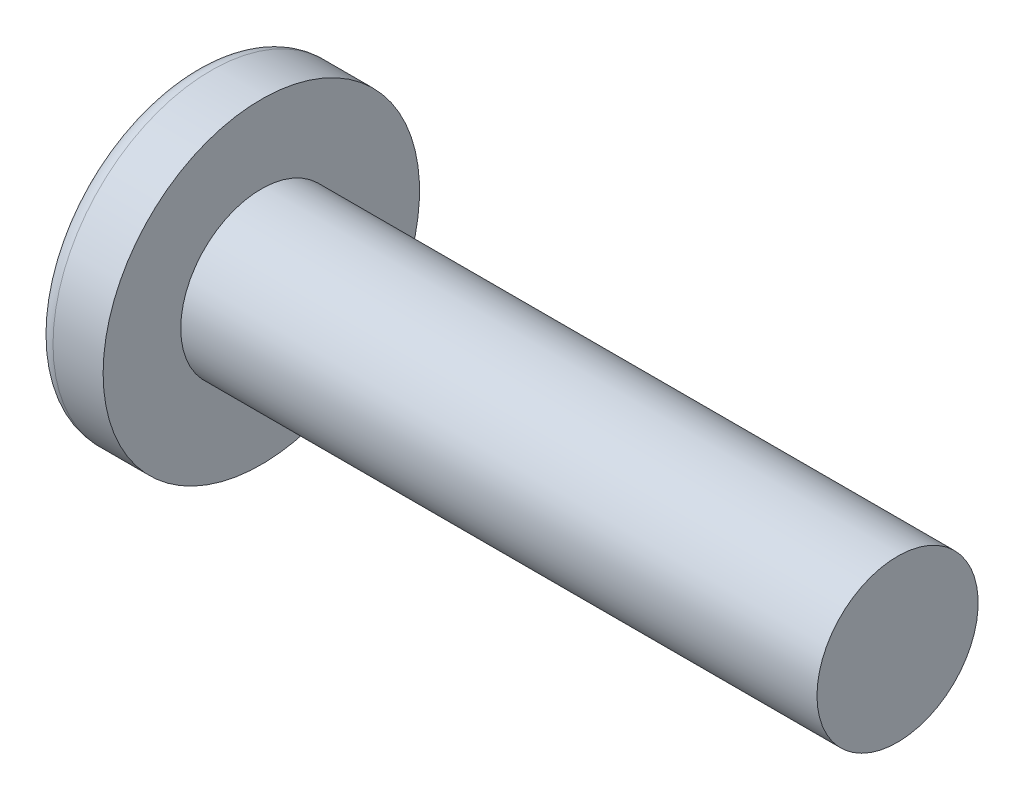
ISO-10303-21;
HEADER;
FILE_DESCRIPTION(('STEP AP214'),'2;1');
FILE_NAME('part.step','',(''),(''),'','','');
FILE_SCHEMA(('AUTOMOTIVE_DESIGN { 1 0 10303 214 1 1 1 1 }'));
ENDSEC;
DATA;
#1=APPLICATION_CONTEXT('core data for automotive mechanical design processes');
#2=APPLICATION_PROTOCOL_DEFINITION('international standard','automotive_design',2000,#1);
#3=PRODUCT_CONTEXT('',#1,'mechanical');
#4=PRODUCT('Part','Part','',(#3));
#5=PRODUCT_RELATED_PRODUCT_CATEGORY('part','',(#4));
#6=PRODUCT_DEFINITION_FORMATION('','',#4);
#7=PRODUCT_DEFINITION_CONTEXT('part definition',#1,'design');
#8=PRODUCT_DEFINITION('design','',#6,#7);
#9=PRODUCT_DEFINITION_SHAPE('','',#8);
#10=(LENGTH_UNIT() NAMED_UNIT(*) SI_UNIT(.MILLI.,.METRE.));
#11=(NAMED_UNIT(*) PLANE_ANGLE_UNIT() SI_UNIT($,.RADIAN.));
#12=(NAMED_UNIT(*) SI_UNIT($,.STERADIAN.) SOLID_ANGLE_UNIT());
#13=UNCERTAINTY_MEASURE_WITH_UNIT(LENGTH_MEASURE(1.E-05),#10,'distance_accuracy_value','');
#14=(GEOMETRIC_REPRESENTATION_CONTEXT(3) GLOBAL_UNCERTAINTY_ASSIGNED_CONTEXT((#13)) GLOBAL_UNIT_ASSIGNED_CONTEXT((#10,
#11,#12)) REPRESENTATION_CONTEXT('',''));
#15=CARTESIAN_POINT('',(0.,0.,0.));
#16=DIRECTION('',(0.,0.,1.));
#17=DIRECTION('',(1.,0.,0.));
#18=AXIS2_PLACEMENT_3D('',#15,#16,#17);
#19=CARTESIAN_POINT('',(3.4798,0.2921,-0.2921));
#20=DIRECTION('',(-1.,0.,0.));
#21=DIRECTION('',(0.,0.,1.));
#22=AXIS2_PLACEMENT_3D('',#19,#20,#21);
#23=PLANE('',#22);
#24=DIRECTION('',(0.,1.,0.));
#25=VECTOR('',#24,1.);
#26=CARTESIAN_POINT('',(3.4798,-0.292100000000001,0.292099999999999));
#27=LINE('',#26,#25);
#28=CARTESIAN_POINT('',(3.4798,-0.2921,0.292099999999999));
#29=VERTEX_POINT('',#28);
#30=CARTESIAN_POINT('',(3.4798,0.292099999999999,0.2921));
#31=VERTEX_POINT('',#30);
#32=EDGE_CURVE('E94',#29,#31,#27,.T.);
#33=ORIENTED_EDGE('',*,*,#32,.T.);
#34=DIRECTION('',(0.,0.,1.));
#35=VECTOR('',#34,1.);
#36=CARTESIAN_POINT('',(3.4798,0.2921,0.2921));
#37=LINE('',#36,#35);
#38=CARTESIAN_POINT('',(3.4798,0.2921,-0.292099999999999));
#39=VERTEX_POINT('',#38);
#40=EDGE_CURVE('E177',#31,#39,#37,.F.);
#41=ORIENTED_EDGE('',*,*,#40,.T.);
#42=DIRECTION('',(0.,1.,0.));
#43=VECTOR('',#42,1.);
#44=CARTESIAN_POINT('',(3.4798,0.292100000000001,-0.292099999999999));
#45=LINE('',#44,#43);
#46=CARTESIAN_POINT('',(3.4798,-0.2921,-0.2921));
#47=VERTEX_POINT('',#46);
#48=EDGE_CURVE('E97',#39,#47,#45,.F.);
#49=ORIENTED_EDGE('',*,*,#48,.T.);
#50=DIRECTION('',(0.,0.,1.));
#51=VECTOR('',#50,1.);
#52=CARTESIAN_POINT('',(3.4798,-0.2921,-0.2921));
#53=LINE('',#52,#51);
#54=EDGE_CURVE('E92',#47,#29,#53,.T.);
#55=ORIENTED_EDGE('',*,*,#54,.T.);
#56=EDGE_LOOP('',(#33,#41,#49,#55));
#57=FACE_BOUND('',#56,.T.);
#58=ADVANCED_FACE('F16',(#57),#23,.T.);
#59=CARTESIAN_POINT('',(3.4798,0.292100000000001,-0.292099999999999));
#60=DIRECTION('',(0.620849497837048,0.,-0.783929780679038));
#61=DIRECTION('',(-0.783929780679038,0.,-0.620849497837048));
#62=AXIS2_PLACEMENT_3D('',#59,#60,#61);
#63=PLANE('',#62);
#64=ORIENTED_EDGE('',*,*,#48,.F.);
#65=DIRECTION('',(0.782237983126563,-0.0656623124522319,0.619509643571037));
#66=VECTOR('',#65,1.);
#67=CARTESIAN_POINT('',(0.49229729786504,0.542875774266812,-2.65811491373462));
#68=LINE('',#67,#66);
#69=CARTESIAN_POINT('',(0.49229729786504,0.542875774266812,-2.65811491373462));
#70=VERTEX_POINT('',#69);
#71=EDGE_CURVE('E156',#70,#39,#68,.T.);
#72=ORIENTED_EDGE('',*,*,#71,.F.);
#73=CARTESIAN_POINT('',(0.492297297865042,-0.542875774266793,-2.65811491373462));
#74=CARTESIAN_POINT('',(0.481787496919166,-0.361917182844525,-2.66643836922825));
#75=CARTESIAN_POINT('',(0.476532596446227,-0.180958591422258,-2.67060009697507));
#76=CARTESIAN_POINT('',(0.476532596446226,0.180958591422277,-2.67060009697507));
#77=CARTESIAN_POINT('',(0.481787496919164,0.361917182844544,-2.66643836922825));
#78=CARTESIAN_POINT('',(0.49229729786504,0.542875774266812,-2.65811491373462));
#79=B_SPLINE_CURVE_WITH_KNOTS('',3,(#73,#74,#75,#76,#77,#78),.UNSPECIFIED.,.F.,.F.,(4,2,4),(0.,
0.543248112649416,1.08649622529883),.UNSPECIFIED.);
#80=CARTESIAN_POINT('',(0.492297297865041,-0.542875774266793,-2.65811491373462));
#81=VERTEX_POINT('',#80);
#82=EDGE_CURVE('E19',#81,#70,#79,.T.);
#83=ORIENTED_EDGE('',*,*,#82,.F.);
#84=DIRECTION('',(-0.782237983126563,-0.0656623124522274,-0.619509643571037));
#85=VECTOR('',#84,1.);
#86=CARTESIAN_POINT('',(3.4798,-0.292099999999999,-0.2921));
#87=LINE('',#86,#85);
#88=EDGE_CURVE('E161',#47,#81,#87,.T.);
#89=ORIENTED_EDGE('',*,*,#88,.F.);
#90=EDGE_LOOP('',(#64,#72,#83,#89));
#91=FACE_BOUND('',#90,.T.);
#92=ADVANCED_FACE('F289',(#91),#63,.F.);
#93=CARTESIAN_POINT('',(3.4798,0.2921,0.2921));
#94=DIRECTION('',(0.620849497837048,0.783929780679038,0.));
#95=DIRECTION('',(-0.783929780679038,0.620849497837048,0.));
#96=AXIS2_PLACEMENT_3D('',#93,#94,#95);
#97=PLANE('',#96);
#98=ORIENTED_EDGE('',*,*,#40,.F.);
#99=DIRECTION('',(0.782237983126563,-0.619509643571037,-0.0656623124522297));
#100=VECTOR('',#99,1.);
#101=CARTESIAN_POINT('',(0.492297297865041,2.65811491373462,0.542875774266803));
#102=LINE('',#101,#100);
#103=CARTESIAN_POINT('',(0.492297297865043,2.65811491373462,0.542875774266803));
#104=VERTEX_POINT('',#103);
#105=EDGE_CURVE('E141',#104,#31,#102,.T.);
#106=ORIENTED_EDGE('',*,*,#105,.F.);
#107=CARTESIAN_POINT('',(0.492297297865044,2.65811491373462,-0.542875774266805));
#108=CARTESIAN_POINT('',(0.481787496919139,2.66643836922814,-0.361917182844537));
#109=CARTESIAN_POINT('',(0.476532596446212,2.67060009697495,-0.180958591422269));
#110=CARTESIAN_POINT('',(0.476532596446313,2.67060009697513,0.18095859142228));
#111=CARTESIAN_POINT('',(0.481787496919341,2.66643836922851,0.361917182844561));
#112=CARTESIAN_POINT('',(0.492297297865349,2.65811491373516,0.542875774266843));
#113=B_SPLINE_CURVE_WITH_KNOTS('',3,(#107,#108,#109,#110,#111,#112),.UNSPECIFIED.,.F.,.F.,(4,2,
4),(0.,0.543248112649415,1.08649622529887),.UNSPECIFIED.);
#114=CARTESIAN_POINT('',(0.492297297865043,2.65811491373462,-0.542875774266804));
#115=VERTEX_POINT('',#114);
#116=EDGE_CURVE('E179',#115,#104,#113,.T.);
#117=ORIENTED_EDGE('',*,*,#116,.F.);
#118=DIRECTION('',(-0.782237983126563,0.619509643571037,-0.0656623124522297));
#119=VECTOR('',#118,1.);
#120=CARTESIAN_POINT('',(3.4798,0.292100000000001,-0.2921));
#121=LINE('',#120,#119);
#122=EDGE_CURVE('E146',#39,#115,#121,.T.);
#123=ORIENTED_EDGE('',*,*,#122,.F.);
#124=EDGE_LOOP('',(#98,#106,#117,#123));
#125=FACE_BOUND('',#124,.T.);
#126=ADVANCED_FACE('F286',(#125),#97,.F.);
#127=CARTESIAN_POINT('',(3.4798,-0.292100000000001,0.292099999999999));
#128=DIRECTION('',(0.620849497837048,0.,0.783929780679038));
#129=DIRECTION('',(0.783929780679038,0.,-0.620849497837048));
#130=AXIS2_PLACEMENT_3D('',#127,#128,#129);
#131=PLANE('',#130);
#132=ORIENTED_EDGE('',*,*,#32,.F.);
#133=DIRECTION('',(0.782237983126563,0.0656623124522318,-0.619509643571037));
#134=VECTOR('',#133,1.);
#135=CARTESIAN_POINT('',(0.492297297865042,-0.542875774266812,2.65811491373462));
#136=LINE('',#135,#134);
#137=CARTESIAN_POINT('',(0.492297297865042,-0.542875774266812,2.65811491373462));
#138=VERTEX_POINT('',#137);
#139=EDGE_CURVE('E105',#138,#29,#136,.T.);
#140=ORIENTED_EDGE('',*,*,#139,.F.);
#141=CARTESIAN_POINT('',(0.492297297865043,0.542875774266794,2.65811491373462));
#142=CARTESIAN_POINT('',(0.481787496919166,0.361917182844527,2.66643836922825));
#143=CARTESIAN_POINT('',(0.476532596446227,0.180958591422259,2.67060009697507));
#144=CARTESIAN_POINT('',(0.476532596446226,-0.180958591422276,2.67060009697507));
#145=CARTESIAN_POINT('',(0.481787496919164,-0.361917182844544,2.66643836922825));
#146=CARTESIAN_POINT('',(0.492297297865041,-0.542875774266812,2.65811491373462));
#147=B_SPLINE_CURVE_WITH_KNOTS('',3,(#141,#142,#143,#144,#145,#146),.UNSPECIFIED.,.F.,.F.,(4,2,
4),(0.,0.543248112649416,1.08649622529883),.UNSPECIFIED.);
#148=CARTESIAN_POINT('',(0.492297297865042,0.542875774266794,2.65811491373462));
#149=VERTEX_POINT('',#148);
#150=EDGE_CURVE('E110',#149,#138,#147,.T.);
#151=ORIENTED_EDGE('',*,*,#150,.F.);
#152=DIRECTION('',(-0.782237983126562,0.0656623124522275,0.619509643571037));
#153=VECTOR('',#152,1.);
#154=CARTESIAN_POINT('',(3.4798,0.292099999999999,0.2921));
#155=LINE('',#154,#153);
#156=EDGE_CURVE('E108',#31,#149,#155,.T.);
#157=ORIENTED_EDGE('',*,*,#156,.F.);
#158=EDGE_LOOP('',(#132,#140,#151,#157));
#159=FACE_BOUND('',#158,.T.);
#160=ADVANCED_FACE('F104',(#159),#131,.F.);
#161=CARTESIAN_POINT('',(3.4798,-0.2921,-0.2921));
#162=DIRECTION('',(0.620849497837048,-0.783929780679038,0.));
#163=DIRECTION('',(0.783929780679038,0.620849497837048,0.));
#164=AXIS2_PLACEMENT_3D('',#161,#162,#163);
#165=PLANE('',#164);
#166=ORIENTED_EDGE('',*,*,#54,.F.);
#167=DIRECTION('',(0.782237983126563,0.619509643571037,0.0656623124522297));
#168=VECTOR('',#167,1.);
#169=CARTESIAN_POINT('',(0.49229729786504,-2.65811491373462,-0.542875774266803));
#170=LINE('',#169,#168);
#171=CARTESIAN_POINT('',(0.492297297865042,-2.65811491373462,-0.542875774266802));
#172=VERTEX_POINT('',#171);
#173=EDGE_CURVE('E98',#172,#47,#170,.T.);
#174=ORIENTED_EDGE('',*,*,#173,.F.);
#175=CARTESIAN_POINT('',(0.492297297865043,-2.65811491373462,0.5428757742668));
#176=CARTESIAN_POINT('',(0.481787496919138,-2.66643836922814,0.361917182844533));
#177=CARTESIAN_POINT('',(0.476532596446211,-2.67060009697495,0.180958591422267));
#178=CARTESIAN_POINT('',(0.476532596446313,-2.67060009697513,-0.180958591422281));
#179=CARTESIAN_POINT('',(0.481787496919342,-2.6664383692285,-0.361917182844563));
#180=CARTESIAN_POINT('',(0.492297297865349,-2.65811491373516,-0.542875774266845));
#181=B_SPLINE_CURVE_WITH_KNOTS('',3,(#175,#176,#177,#178,#179,#180),.UNSPECIFIED.,.F.,.F.,(4,2,
4),(0.,0.543248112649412,1.08649622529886),.UNSPECIFIED.);
#182=CARTESIAN_POINT('',(0.492297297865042,-2.65811491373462,0.542875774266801));
#183=VERTEX_POINT('',#182);
#184=EDGE_CURVE('E38',#183,#172,#181,.T.);
#185=ORIENTED_EDGE('',*,*,#184,.F.);
#186=DIRECTION('',(-0.782237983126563,-0.619509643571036,0.0656623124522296));
#187=VECTOR('',#186,1.);
#188=CARTESIAN_POINT('',(3.4798,-0.292100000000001,0.2921));
#189=LINE('',#188,#187);
#190=EDGE_CURVE('E120',#29,#183,#189,.T.);
#191=ORIENTED_EDGE('',*,*,#190,.F.);
#192=EDGE_LOOP('',(#166,#174,#185,#191));
#193=FACE_BOUND('',#192,.T.);
#194=ADVANCED_FACE('F121',(#193),#165,.F.);
#195=CARTESIAN_POINT('',(3.8486267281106,0.,-0.261140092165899));
#196=DIRECTION('',(-0.0836474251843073,0.,0.996495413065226));
#197=DIRECTION('',(0.996495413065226,0.,0.0836474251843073));
#198=AXIS2_PLACEMENT_3D('',#195,#196,#197);
#199=PLANE('',#198);
#200=DIRECTION('',(0.993027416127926,0.0833563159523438,0.0833563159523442));
#201=VECTOR('',#200,1.);
#202=CARTESIAN_POINT('',(0.0437691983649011,-0.580525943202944,-0.580525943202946));
#203=LINE('',#202,#201);
#204=CARTESIAN_POINT('',(0.0437691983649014,-0.580525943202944,-0.580525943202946));
#205=VERTEX_POINT('',#204);
#206=EDGE_CURVE('E72',#205,#47,#203,.T.);
#207=ORIENTED_EDGE('',*,*,#206,.F.);
#208=CARTESIAN_POINT('',(0.492297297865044,-2.65811491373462,-0.542875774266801));
#209=CARTESIAN_POINT('',(0.461687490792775,-2.57434226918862,-0.545445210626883));
#210=CARTESIAN_POINT('',(0.43252593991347,-2.4900367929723,-0.54789307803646));
#211=CARTESIAN_POINT('',(0.377230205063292,-2.32076418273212,-0.552534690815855));
#212=CARTESIAN_POINT('',(0.351085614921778,-2.23580047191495,-0.554729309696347));
#213=CARTESIAN_POINT('',(0.301794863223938,-2.06522014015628,-0.558866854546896));
#214=CARTESIAN_POINT('',(0.2786417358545,-1.9796055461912,-0.560810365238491));
#215=CARTESIAN_POINT('',(0.235314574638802,-1.80772917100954,-0.5644473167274));
#216=CARTESIAN_POINT('',(0.2151370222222,-1.72146828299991,-0.566141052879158));
#217=CARTESIAN_POINT('',(0.177752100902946,-1.54830075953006,-0.569279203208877));
#218=CARTESIAN_POINT('',(0.160544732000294,-1.46139412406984,-0.570723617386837));
#219=CARTESIAN_POINT('',(0.129101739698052,-1.28693401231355,-0.573362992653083));
#220=CARTESIAN_POINT('',(0.114869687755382,-1.19937988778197,-0.574557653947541));
#221=CARTESIAN_POINT('',(0.0893900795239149,-1.0236227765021,-0.576696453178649));
#222=CARTESIAN_POINT('',(0.0781497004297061,-0.935418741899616,-0.577639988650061));
#223=CARTESIAN_POINT('',(0.0586759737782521,-0.758358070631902,-0.579274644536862));
#224=CARTESIAN_POINT('',(0.0504535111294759,-0.669500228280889,-0.579964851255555));
#225=CARTESIAN_POINT('',(0.0437691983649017,-0.580525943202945,-0.580525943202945));
#226=B_SPLINE_CURVE_WITH_KNOTS('',3,(#208,#209,#210,#211,#212,#213,#214,#215,#216,#217,#218,
#219,#220,#221,#222,#223,#224,#225),.UNSPECIFIED.,.F.,.F.,(4,2,2,2,2,2,2,2,4),(0.,
0.267666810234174,0.534380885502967,0.800462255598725,1.06622642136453,1.33199058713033,
1.59807195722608,1.86478603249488,2.13245284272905),.UNSPECIFIED.);
#227=EDGE_CURVE('E124',#172,#205,#226,.T.);
#228=ORIENTED_EDGE('',*,*,#227,.F.);
#229=ORIENTED_EDGE('',*,*,#173,.T.);
#230=EDGE_LOOP('',(#207,#228,#229));
#231=FACE_BOUND('',#230,.T.);
#232=ADVANCED_FACE('F258',(#231),#199,.T.);
#233=CARTESIAN_POINT('',(3.8486267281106,-0.261140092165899,0.));
#234=DIRECTION('',(-0.0836474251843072,0.996495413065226,0.));
#235=DIRECTION('',(-0.996495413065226,-0.0836474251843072,0.));
#236=AXIS2_PLACEMENT_3D('',#233,#234,#235);
#237=PLANE('',#236);
#238=ORIENTED_EDGE('',*,*,#206,.T.);
#239=ORIENTED_EDGE('',*,*,#88,.T.);
#240=CARTESIAN_POINT('',(0.0437691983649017,-0.580525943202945,-0.580525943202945));
#241=CARTESIAN_POINT('',(0.0504535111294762,-0.579964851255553,-0.66950022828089));
#242=CARTESIAN_POINT('',(0.0586759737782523,-0.579274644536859,-0.758358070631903));
#243=CARTESIAN_POINT('',(0.078149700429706,-0.577639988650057,-0.935418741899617));
#244=CARTESIAN_POINT('',(0.0893900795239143,-0.576696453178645,-1.0236227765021));
#245=CARTESIAN_POINT('',(0.114869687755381,-0.574557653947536,-1.19937988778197));
#246=CARTESIAN_POINT('',(0.129101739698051,-0.573362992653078,-1.28693401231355));
#247=CARTESIAN_POINT('',(0.160544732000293,-0.570723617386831,-1.46139412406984));
#248=CARTESIAN_POINT('',(0.177752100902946,-0.569279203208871,-1.54830075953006));
#249=CARTESIAN_POINT('',(0.2151370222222,-0.566141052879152,-1.72146828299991));
#250=CARTESIAN_POINT('',(0.235314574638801,-0.564447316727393,-1.80772917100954));
#251=CARTESIAN_POINT('',(0.2786417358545,-0.560810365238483,-1.9796055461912));
#252=CARTESIAN_POINT('',(0.301794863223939,-0.558866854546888,-2.06522014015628));
#253=CARTESIAN_POINT('',(0.35108561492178,-0.554729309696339,-2.23580047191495));
#254=CARTESIAN_POINT('',(0.377230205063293,-0.552534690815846,-2.32076418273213));
#255=CARTESIAN_POINT('',(0.43252593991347,-0.547893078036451,-2.4900367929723));
#256=CARTESIAN_POINT('',(0.461687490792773,-0.545445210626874,-2.57434226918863));
#257=CARTESIAN_POINT('',(0.492297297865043,-0.542875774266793,-2.65811491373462));
#258=B_SPLINE_CURVE_WITH_KNOTS('',3,(#240,#241,#242,#243,#244,#245,#246,#247,#248,#249,#250,
#251,#252,#253,#254,#255,#256,#257),.UNSPECIFIED.,.F.,.F.,(4,2,2,2,2,2,2,2,4),(0.,
0.267666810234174,0.534380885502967,0.800462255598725,1.06622642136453,1.33199058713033,
1.59807195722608,1.86478603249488,2.13245284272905),.UNSPECIFIED.);
#259=EDGE_CURVE('E262',#205,#81,#258,.T.);
#260=ORIENTED_EDGE('',*,*,#259,.F.);
#261=EDGE_LOOP('',(#238,#239,#260));
#262=FACE_BOUND('',#261,.T.);
#263=ADVANCED_FACE('F253',(#262),#237,.T.);
#264=CARTESIAN_POINT('',(3.8486267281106,0.261140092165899,0.));
#265=DIRECTION('',(-0.0836474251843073,-0.996495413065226,0.));
#266=DIRECTION('',(0.996495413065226,-0.0836474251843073,0.));
#267=AXIS2_PLACEMENT_3D('',#264,#265,#266);
#268=PLANE('',#267);
#269=ORIENTED_EDGE('',*,*,#71,.T.);
#270=DIRECTION('',(0.993027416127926,-0.0833563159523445,0.0833563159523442));
#271=VECTOR('',#270,1.);
#272=CARTESIAN_POINT('',(0.0437691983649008,0.580525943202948,-0.580525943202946));
#273=LINE('',#272,#271);
#274=CARTESIAN_POINT('',(0.0437691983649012,0.580525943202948,-0.580525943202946));
#275=VERTEX_POINT('',#274);
#276=EDGE_CURVE('E151',#275,#39,#273,.T.);
#277=ORIENTED_EDGE('',*,*,#276,.F.);
#278=CARTESIAN_POINT('',(0.492297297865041,0.542875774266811,-2.65811491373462));
#279=CARTESIAN_POINT('',(0.461687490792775,0.545445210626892,-2.57434226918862));
#280=CARTESIAN_POINT('',(0.432525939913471,0.547893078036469,-2.4900367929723));
#281=CARTESIAN_POINT('',(0.377230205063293,0.552534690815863,-2.32076418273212));
#282=CARTESIAN_POINT('',(0.351085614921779,0.554729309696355,-2.23580047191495));
#283=CARTESIAN_POINT('',(0.301794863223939,0.558866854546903,-2.06522014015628));
#284=CARTESIAN_POINT('',(0.278641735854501,0.560810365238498,-1.9796055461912));
#285=CARTESIAN_POINT('',(0.235314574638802,0.564447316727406,-1.80772917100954));
#286=CARTESIAN_POINT('',(0.2151370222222,0.566141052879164,-1.72146828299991));
#287=CARTESIAN_POINT('',(0.177752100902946,0.569279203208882,-1.54830075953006));
#288=CARTESIAN_POINT('',(0.160544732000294,0.570723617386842,-1.46139412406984));
#289=CARTESIAN_POINT('',(0.129101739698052,0.573362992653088,-1.28693401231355));
#290=CARTESIAN_POINT('',(0.114869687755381,0.574557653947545,-1.19937988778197));
#291=CARTESIAN_POINT('',(0.0893900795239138,0.576696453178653,-1.0236227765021));
#292=CARTESIAN_POINT('',(0.0781497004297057,0.577639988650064,-0.935418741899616));
#293=CARTESIAN_POINT('',(0.0586759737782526,0.579274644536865,-0.758358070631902));
#294=CARTESIAN_POINT('',(0.0504535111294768,0.579964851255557,-0.66950022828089));
#295=CARTESIAN_POINT('',(0.0437691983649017,0.580525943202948,-0.580525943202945));
#296=B_SPLINE_CURVE_WITH_KNOTS('',3,(#278,#279,#280,#281,#282,#283,#284,#285,#286,#287,#288,
#289,#290,#291,#292,#293,#294,#295),.UNSPECIFIED.,.F.,.F.,(4,2,2,2,2,2,2,2,4),(0.,
0.267666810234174,0.534380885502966,0.800462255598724,1.06622642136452,1.33199058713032,
1.59807195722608,1.86478603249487,2.13245284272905),.UNSPECIFIED.);
#297=EDGE_CURVE('E239',#70,#275,#296,.T.);
#298=ORIENTED_EDGE('',*,*,#297,.F.);
#299=EDGE_LOOP('',(#269,#277,#298));
#300=FACE_BOUND('',#299,.T.);
#301=ADVANCED_FACE('F248',(#300),#268,.T.);
#302=CARTESIAN_POINT('',(3.8486267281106,0.,-0.261140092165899));
#303=DIRECTION('',(-0.0836474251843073,0.,0.996495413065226));
#304=DIRECTION('',(0.996495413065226,0.,0.0836474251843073));
#305=AXIS2_PLACEMENT_3D('',#302,#303,#304);
#306=PLANE('',#305);
#307=ORIENTED_EDGE('',*,*,#276,.T.);
#308=ORIENTED_EDGE('',*,*,#122,.T.);
#309=CARTESIAN_POINT('',(0.0437691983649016,0.580525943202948,-0.580525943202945));
#310=CARTESIAN_POINT('',(0.0504535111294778,0.669500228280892,-0.579964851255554));
#311=CARTESIAN_POINT('',(0.0586759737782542,0.758358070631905,-0.579274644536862));
#312=CARTESIAN_POINT('',(0.0781497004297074,0.935418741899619,-0.577639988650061));
#313=CARTESIAN_POINT('',(0.0893900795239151,1.0236227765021,-0.576696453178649));
#314=CARTESIAN_POINT('',(0.114869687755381,1.19937988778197,-0.574557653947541));
#315=CARTESIAN_POINT('',(0.129101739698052,1.28693401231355,-0.573362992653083));
#316=CARTESIAN_POINT('',(0.160544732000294,1.46139412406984,-0.570723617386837));
#317=CARTESIAN_POINT('',(0.177752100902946,1.54830075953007,-0.569279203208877));
#318=CARTESIAN_POINT('',(0.215137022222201,1.72146828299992,-0.566141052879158));
#319=CARTESIAN_POINT('',(0.235314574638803,1.80772917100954,-0.5644473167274));
#320=CARTESIAN_POINT('',(0.278641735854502,1.9796055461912,-0.56081036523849));
#321=CARTESIAN_POINT('',(0.301794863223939,2.06522014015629,-0.558866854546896));
#322=CARTESIAN_POINT('',(0.351085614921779,2.23580047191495,-0.554729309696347));
#323=CARTESIAN_POINT('',(0.377230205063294,2.32076418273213,-0.552534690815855));
#324=CARTESIAN_POINT('',(0.432525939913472,2.4900367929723,-0.54789307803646));
#325=CARTESIAN_POINT('',(0.461687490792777,2.57434226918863,-0.545445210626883));
#326=CARTESIAN_POINT('',(0.492297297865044,2.65811491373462,-0.542875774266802));
#327=B_SPLINE_CURVE_WITH_KNOTS('',3,(#309,#310,#311,#312,#313,#314,#315,#316,#317,#318,#319,
#320,#321,#322,#323,#324,#325,#326),.UNSPECIFIED.,.F.,.F.,(4,2,2,2,2,2,2,2,4),(0.,
0.267666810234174,0.534380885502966,0.800462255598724,1.06622642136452,1.33199058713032,
1.59807195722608,1.86478603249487,2.13245284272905),.UNSPECIFIED.);
#328=EDGE_CURVE('E233',#275,#115,#327,.T.);
#329=ORIENTED_EDGE('',*,*,#328,.F.);
#330=EDGE_LOOP('',(#307,#308,#329));
#331=FACE_BOUND('',#330,.T.);
#332=ADVANCED_FACE('F245',(#331),#306,.T.);
#333=CARTESIAN_POINT('',(3.8486267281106,0.,0.261140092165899));
#334=DIRECTION('',(-0.0836474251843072,0.,-0.996495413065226));
#335=DIRECTION('',(-0.996495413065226,0.,0.0836474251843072));
#336=AXIS2_PLACEMENT_3D('',#333,#334,#335);
#337=PLANE('',#336);
#338=DIRECTION('',(0.993027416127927,-0.0833563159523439,-0.0833563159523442));
#339=VECTOR('',#338,1.);
#340=CARTESIAN_POINT('',(0.0437691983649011,0.580525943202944,0.580525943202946));
#341=LINE('',#340,#339);
#342=CARTESIAN_POINT('',(0.0437691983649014,0.580525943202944,0.580525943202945));
#343=VERTEX_POINT('',#342);
#344=EDGE_CURVE('E137',#343,#31,#341,.T.);
#345=ORIENTED_EDGE('',*,*,#344,.F.);
#346=CARTESIAN_POINT('',(0.492297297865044,2.65811491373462,0.542875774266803));
#347=CARTESIAN_POINT('',(0.461687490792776,2.57434226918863,0.545445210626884));
#348=CARTESIAN_POINT('',(0.432525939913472,2.4900367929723,0.54789307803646));
#349=CARTESIAN_POINT('',(0.377230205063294,2.32076418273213,0.552534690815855));
#350=CARTESIAN_POINT('',(0.351085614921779,2.23580047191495,0.554729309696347));
#351=CARTESIAN_POINT('',(0.301794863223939,2.06522014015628,0.558866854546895));
#352=CARTESIAN_POINT('',(0.278641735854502,1.9796055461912,0.560810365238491));
#353=CARTESIAN_POINT('',(0.235314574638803,1.80772917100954,0.5644473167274));
#354=CARTESIAN_POINT('',(0.215137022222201,1.72146828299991,0.566141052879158));
#355=CARTESIAN_POINT('',(0.177752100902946,1.54830075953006,0.569279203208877));
#356=CARTESIAN_POINT('',(0.160544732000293,1.46139412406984,0.570723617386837));
#357=CARTESIAN_POINT('',(0.129101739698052,1.28693401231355,0.573362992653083));
#358=CARTESIAN_POINT('',(0.114869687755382,1.19937988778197,0.574557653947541));
#359=CARTESIAN_POINT('',(0.0893900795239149,1.0236227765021,0.576696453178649));
#360=CARTESIAN_POINT('',(0.0781497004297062,0.935418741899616,0.577639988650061));
#361=CARTESIAN_POINT('',(0.058675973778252,0.758358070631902,0.579274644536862));
#362=CARTESIAN_POINT('',(0.0504535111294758,0.669500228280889,0.579964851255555));
#363=CARTESIAN_POINT('',(0.0437691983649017,0.580525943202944,0.580525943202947));
#364=B_SPLINE_CURVE_WITH_KNOTS('',3,(#346,#347,#348,#349,#350,#351,#352,#353,#354,#355,#356,
#357,#358,#359,#360,#361,#362,#363),.UNSPECIFIED.,.F.,.F.,(4,2,2,2,2,2,2,2,4),(0.,
0.267666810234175,0.534380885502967,0.800462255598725,1.06622642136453,1.33199058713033,
1.59807195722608,1.86478603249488,2.13245284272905),.UNSPECIFIED.);
#365=EDGE_CURVE('E227',#104,#343,#364,.T.);
#366=ORIENTED_EDGE('',*,*,#365,.F.);
#367=ORIENTED_EDGE('',*,*,#105,.T.);
#368=EDGE_LOOP('',(#345,#366,#367));
#369=FACE_BOUND('',#368,.T.);
#370=ADVANCED_FACE('F217',(#369),#337,.T.);
#371=CARTESIAN_POINT('',(3.8486267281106,0.261140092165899,0.));
#372=DIRECTION('',(-0.0836474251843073,-0.996495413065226,0.));
#373=DIRECTION('',(0.996495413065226,-0.0836474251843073,0.));
#374=AXIS2_PLACEMENT_3D('',#371,#372,#373);
#375=PLANE('',#374);
#376=ORIENTED_EDGE('',*,*,#344,.T.);
#377=ORIENTED_EDGE('',*,*,#156,.T.);
#378=CARTESIAN_POINT('',(0.0437691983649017,0.580525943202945,0.580525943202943));
#379=CARTESIAN_POINT('',(0.0504535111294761,0.579964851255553,0.669500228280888));
#380=CARTESIAN_POINT('',(0.0586759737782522,0.579274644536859,0.758358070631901));
#381=CARTESIAN_POINT('',(0.0781497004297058,0.577639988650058,0.935418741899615));
#382=CARTESIAN_POINT('',(0.0893900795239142,0.576696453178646,1.0236227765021));
#383=CARTESIAN_POINT('',(0.114869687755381,0.574557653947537,1.19937988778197));
#384=CARTESIAN_POINT('',(0.129101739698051,0.573362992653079,1.28693401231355));
#385=CARTESIAN_POINT('',(0.160544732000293,0.570723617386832,1.46139412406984));
#386=CARTESIAN_POINT('',(0.177752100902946,0.569279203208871,1.54830075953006));
#387=CARTESIAN_POINT('',(0.2151370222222,0.566141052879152,1.72146828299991));
#388=CARTESIAN_POINT('',(0.235314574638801,0.564447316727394,1.80772917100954));
#389=CARTESIAN_POINT('',(0.2786417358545,0.560810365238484,1.9796055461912));
#390=CARTESIAN_POINT('',(0.301794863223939,0.558866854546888,2.06522014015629));
#391=CARTESIAN_POINT('',(0.35108561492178,0.554729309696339,2.23580047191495));
#392=CARTESIAN_POINT('',(0.377230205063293,0.552534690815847,2.32076418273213));
#393=CARTESIAN_POINT('',(0.43252593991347,0.547893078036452,2.4900367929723));
#394=CARTESIAN_POINT('',(0.461687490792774,0.545445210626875,2.57434226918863));
#395=CARTESIAN_POINT('',(0.492297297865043,0.542875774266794,2.65811491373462));
#396=B_SPLINE_CURVE_WITH_KNOTS('',3,(#378,#379,#380,#381,#382,#383,#384,#385,#386,#387,#388,
#389,#390,#391,#392,#393,#394,#395),.UNSPECIFIED.,.F.,.F.,(4,2,2,2,2,2,2,2,4),(0.,
0.267666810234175,0.534380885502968,0.800462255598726,1.06622642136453,1.33199058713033,
1.59807195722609,1.86478603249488,2.13245284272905),.UNSPECIFIED.);
#397=EDGE_CURVE('E221',#343,#149,#396,.T.);
#398=ORIENTED_EDGE('',*,*,#397,.F.);
#399=EDGE_LOOP('',(#376,#377,#398));
#400=FACE_BOUND('',#399,.T.);
#401=ADVANCED_FACE('F213',(#400),#375,.T.);
#402=CARTESIAN_POINT('',(3.8486267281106,-0.261140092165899,0.));
#403=DIRECTION('',(-0.0836474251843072,0.996495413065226,0.));
#404=DIRECTION('',(-0.996495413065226,-0.0836474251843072,0.));
#405=AXIS2_PLACEMENT_3D('',#402,#403,#404);
#406=PLANE('',#405);
#407=ORIENTED_EDGE('',*,*,#139,.T.);
#408=DIRECTION('',(0.993027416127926,0.0833563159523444,-0.0833563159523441));
#409=VECTOR('',#408,1.);
#410=CARTESIAN_POINT('',(0.0437691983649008,-0.580525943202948,0.580525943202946));
#411=LINE('',#410,#409);
#412=CARTESIAN_POINT('',(0.0437691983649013,-0.580525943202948,0.580525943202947));
#413=VERTEX_POINT('',#412);
#414=EDGE_CURVE('E115',#413,#29,#411,.T.);
#415=ORIENTED_EDGE('',*,*,#414,.F.);
#416=CARTESIAN_POINT('',(0.492297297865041,-0.542875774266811,2.65811491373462));
#417=CARTESIAN_POINT('',(0.461687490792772,-0.545445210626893,2.57434226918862));
#418=CARTESIAN_POINT('',(0.432525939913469,-0.547893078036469,2.4900367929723));
#419=CARTESIAN_POINT('',(0.377230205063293,-0.552534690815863,2.32076418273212));
#420=CARTESIAN_POINT('',(0.351085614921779,-0.554729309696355,2.23580047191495));
#421=CARTESIAN_POINT('',(0.301794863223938,-0.558866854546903,2.06522014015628));
#422=CARTESIAN_POINT('',(0.2786417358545,-0.560810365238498,1.9796055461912));
#423=CARTESIAN_POINT('',(0.235314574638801,-0.564447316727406,1.80772917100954));
#424=CARTESIAN_POINT('',(0.215137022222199,-0.566141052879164,1.72146828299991));
#425=CARTESIAN_POINT('',(0.177752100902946,-0.569279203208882,1.54830075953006));
#426=CARTESIAN_POINT('',(0.160544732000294,-0.570723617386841,1.46139412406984));
#427=CARTESIAN_POINT('',(0.129101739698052,-0.573362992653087,1.28693401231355));
#428=CARTESIAN_POINT('',(0.114869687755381,-0.574557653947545,1.19937988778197));
#429=CARTESIAN_POINT('',(0.0893900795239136,-0.576696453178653,1.0236227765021));
#430=CARTESIAN_POINT('',(0.0781497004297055,-0.577639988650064,0.935418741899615));
#431=CARTESIAN_POINT('',(0.0586759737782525,-0.579274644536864,0.758358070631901));
#432=CARTESIAN_POINT('',(0.0504535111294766,-0.579964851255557,0.669500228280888));
#433=CARTESIAN_POINT('',(0.0437691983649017,-0.580525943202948,0.580525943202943));
#434=B_SPLINE_CURVE_WITH_KNOTS('',3,(#416,#417,#418,#419,#420,#421,#422,#423,#424,#425,#426,
#427,#428,#429,#430,#431,#432,#433),.UNSPECIFIED.,.F.,.F.,(4,2,2,2,2,2,2,2,4),(0.,
0.267666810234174,0.534380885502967,0.800462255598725,1.06622642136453,1.33199058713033,
1.59807195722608,1.86478603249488,2.13245284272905),.UNSPECIFIED.);
#435=EDGE_CURVE('E118',#138,#413,#434,.T.);
#436=ORIENTED_EDGE('',*,*,#435,.F.);
#437=EDGE_LOOP('',(#407,#415,#436));
#438=FACE_BOUND('',#437,.T.);
#439=ADVANCED_FACE('F113',(#438),#406,.T.);
#440=CARTESIAN_POINT('',(3.8486267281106,0.,0.261140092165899));
#441=DIRECTION('',(-0.0836474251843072,0.,-0.996495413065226));
#442=DIRECTION('',(-0.996495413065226,0.,0.0836474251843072));
#443=AXIS2_PLACEMENT_3D('',#440,#441,#442);
#444=PLANE('',#443);
#445=ORIENTED_EDGE('',*,*,#414,.T.);
#446=ORIENTED_EDGE('',*,*,#190,.T.);
#447=CARTESIAN_POINT('',(0.0437691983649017,-0.580525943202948,0.580525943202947));
#448=CARTESIAN_POINT('',(0.0504535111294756,-0.669500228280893,0.579964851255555));
#449=CARTESIAN_POINT('',(0.0586759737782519,-0.758358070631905,0.579274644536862));
#450=CARTESIAN_POINT('',(0.0781497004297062,-0.935418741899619,0.577639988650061));
#451=CARTESIAN_POINT('',(0.0893900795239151,-1.0236227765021,0.576696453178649));
#452=CARTESIAN_POINT('',(0.114869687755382,-1.19937988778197,0.57455765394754));
#453=CARTESIAN_POINT('',(0.129101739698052,-1.28693401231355,0.573362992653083));
#454=CARTESIAN_POINT('',(0.160544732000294,-1.46139412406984,0.570723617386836));
#455=CARTESIAN_POINT('',(0.177752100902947,-1.54830075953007,0.569279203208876));
#456=CARTESIAN_POINT('',(0.215137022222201,-1.72146828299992,0.566141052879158));
#457=CARTESIAN_POINT('',(0.235314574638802,-1.80772917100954,0.564447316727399));
#458=CARTESIAN_POINT('',(0.2786417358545,-1.9796055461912,0.56081036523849));
#459=CARTESIAN_POINT('',(0.301794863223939,-2.06522014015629,0.558866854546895));
#460=CARTESIAN_POINT('',(0.351085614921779,-2.23580047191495,0.554729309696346));
#461=CARTESIAN_POINT('',(0.377230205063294,-2.32076418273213,0.552534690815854));
#462=CARTESIAN_POINT('',(0.432525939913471,-2.4900367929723,0.54789307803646));
#463=CARTESIAN_POINT('',(0.461687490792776,-2.57434226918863,0.545445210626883));
#464=CARTESIAN_POINT('',(0.492297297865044,-2.65811491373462,0.542875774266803));
#465=B_SPLINE_CURVE_WITH_KNOTS('',3,(#447,#448,#449,#450,#451,#452,#453,#454,#455,#456,#457,
#458,#459,#460,#461,#462,#463,#464),.UNSPECIFIED.,.F.,.F.,(4,2,2,2,2,2,2,2,4),(0.,
0.267666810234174,0.534380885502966,0.800462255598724,1.06622642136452,1.33199058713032,
1.59807195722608,1.86478603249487,2.13245284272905),.UNSPECIFIED.);
#466=EDGE_CURVE('E127',#413,#183,#465,.T.);
#467=ORIENTED_EDGE('',*,*,#466,.F.);
#468=EDGE_LOOP('',(#445,#446,#467));
#469=FACE_BOUND('',#468,.T.);
#470=ADVANCED_FACE('F126',(#469),#444,.T.);
#471=CARTESIAN_POINT('',(7.7216,0.,0.));
#472=DIRECTION('',(0.,1.,0.));
#473=DIRECTION('',(1.,0.,0.));
#474=AXIS2_PLACEMENT_3D('',#471,#472,#473);
#475=SPHERICAL_SURFACE('',#474,7.7216);
#476=CARTESIAN_POINT('',(1.46619704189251,0.,0.));
#477=DIRECTION('',(-1.,0.,0.));
#478=DIRECTION('',(0.,0.,1.));
#479=AXIS2_PLACEMENT_3D('',#476,#477,#478);
#480=CIRCLE('',#479,4.52692394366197);
#481=CARTESIAN_POINT('',(1.46619704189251,0.,4.52692394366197));
#482=VERTEX_POINT('',#481);
#483=EDGE_CURVE('E191',#482,#482,#480,.F.);
#484=ORIENTED_EDGE('',*,*,#483,.F.);
#485=EDGE_LOOP('',(#484));
#486=FACE_BOUND('',#485,.T.);
#487=ORIENTED_EDGE('',*,*,#466,.T.);
#488=ORIENTED_EDGE('',*,*,#184,.T.);
#489=ORIENTED_EDGE('',*,*,#227,.T.);
#490=ORIENTED_EDGE('',*,*,#259,.T.);
#491=ORIENTED_EDGE('',*,*,#82,.T.);
#492=ORIENTED_EDGE('',*,*,#297,.T.);
#493=ORIENTED_EDGE('',*,*,#328,.T.);
#494=ORIENTED_EDGE('',*,*,#116,.T.);
#495=ORIENTED_EDGE('',*,*,#365,.T.);
#496=ORIENTED_EDGE('',*,*,#397,.T.);
#497=ORIENTED_EDGE('',*,*,#150,.T.);
#498=ORIENTED_EDGE('',*,*,#435,.T.);
#499=EDGE_LOOP('',(#487,#488,#489,#490,#491,#492,#493,#494,#495,#496,#497,#498));
#500=FACE_BOUND('',#499,.T.);
#501=ADVANCED_FACE('F204',(#486,#500),#475,.T.);
#502=CARTESIAN_POINT('',(1.87773671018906,0.,0.));
#503=DIRECTION('',(-1.,0.,0.));
#504=DIRECTION('',(0.,0.,1.));
#505=AXIS2_PLACEMENT_3D('',#502,#503,#504);
#506=TOROIDAL_SURFACE('',#505,4.2291,0.508000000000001);
#507=ORIENTED_EDGE('',*,*,#483,.T.);
#508=EDGE_LOOP('',(#507));
#509=FACE_BOUND('',#508,.T.);
#510=CARTESIAN_POINT('',(1.87773671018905,0.,0.));
#511=DIRECTION('',(-1.,0.,0.));
#512=DIRECTION('',(0.,0.,1.));
#513=AXIS2_PLACEMENT_3D('',#510,#511,#512);
#514=CIRCLE('',#513,4.7371);
#515=CARTESIAN_POINT('',(1.87773671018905,0.,4.7371));
#516=VERTEX_POINT('',#515);
#517=EDGE_CURVE('E190',#516,#516,#514,.F.);
#518=ORIENTED_EDGE('',*,*,#517,.F.);
#519=EDGE_LOOP('',(#518));
#520=FACE_BOUND('',#519,.T.);
#521=ADVANCED_FACE('F325',(#509,#520),#506,.T.);
#522=CARTESIAN_POINT('',(-25.4,0.,0.));
#523=DIRECTION('',(-1.,0.,0.));
#524=DIRECTION('',(0.,0.,1.));
#525=AXIS2_PLACEMENT_3D('',#522,#523,#524);
#526=CYLINDRICAL_SURFACE('',#525,4.7371);
#527=ORIENTED_EDGE('',*,*,#517,.T.);
#528=EDGE_LOOP('',(#527));
#529=FACE_BOUND('',#528,.T.);
#530=CARTESIAN_POINT('',(3.3782,0.,0.));
#531=DIRECTION('',(-1.,0.,0.));
#532=DIRECTION('',(0.,0.,1.));
#533=AXIS2_PLACEMENT_3D('',#530,#531,#532);
#534=CIRCLE('',#533,4.7371);
#535=CARTESIAN_POINT('',(3.3782,0.,4.7371));
#536=VERTEX_POINT('',#535);
#537=EDGE_CURVE('E187',#536,#536,#534,.T.);
#538=ORIENTED_EDGE('',*,*,#537,.T.);
#539=EDGE_LOOP('',(#538));
#540=FACE_BOUND('',#539,.T.);
#541=ADVANCED_FACE('F322',(#529,#540),#526,.T.);
#542=CARTESIAN_POINT('',(22.4282,2.413,0.));
#543=DIRECTION('',(1.,0.,0.));
#544=DIRECTION('',(0.,0.,-1.));
#545=AXIS2_PLACEMENT_3D('',#542,#543,#544);
#546=PLANE('',#545);
#547=CARTESIAN_POINT('',(22.4282,0.,0.));
#548=DIRECTION('',(-1.,0.,0.));
#549=DIRECTION('',(0.,0.,1.));
#550=AXIS2_PLACEMENT_3D('',#547,#548,#549);
#551=CIRCLE('',#550,2.413);
#552=CARTESIAN_POINT('',(22.4282,0.,2.413));
#553=VERTEX_POINT('',#552);
#554=EDGE_CURVE('E29',#553,#553,#551,.T.);
#555=ORIENTED_EDGE('',*,*,#554,.F.);
#556=EDGE_LOOP('',(#555));
#557=FACE_BOUND('',#556,.T.);
#558=ADVANCED_FACE('F315',(#557),#546,.T.);
#559=CARTESIAN_POINT('',(3.3782,2.413,0.));
#560=DIRECTION('',(-1.,0.,0.));
#561=DIRECTION('',(0.,0.,1.));
#562=AXIS2_PLACEMENT_3D('',#559,#560,#561);
#563=PLANE('',#562);
#564=CARTESIAN_POINT('',(3.3782,0.,0.));
#565=DIRECTION('',(-1.,0.,0.));
#566=DIRECTION('',(0.,0.,1.));
#567=AXIS2_PLACEMENT_3D('',#564,#565,#566);
#568=CIRCLE('',#567,2.413);
#569=CARTESIAN_POINT('',(3.3782,0.,2.413));
#570=VERTEX_POINT('',#569);
#571=EDGE_CURVE('E11',#570,#570,#568,.F.);
#572=ORIENTED_EDGE('',*,*,#571,.F.);
#573=EDGE_LOOP('',(#572));
#574=FACE_BOUND('',#573,.T.);
#575=ORIENTED_EDGE('',*,*,#537,.F.);
#576=EDGE_LOOP('',(#575));
#577=FACE_BOUND('',#576,.T.);
#578=ADVANCED_FACE('F309',(#574,#577),#563,.F.);
#579=CARTESIAN_POINT('',(-25.4,0.,0.));
#580=DIRECTION('',(-1.,0.,0.));
#581=DIRECTION('',(0.,0.,1.));
#582=AXIS2_PLACEMENT_3D('',#579,#580,#581);
#583=CYLINDRICAL_SURFACE('',#582,2.413);
#584=ORIENTED_EDGE('',*,*,#571,.T.);
#585=EDGE_LOOP('',(#584));
#586=FACE_BOUND('',#585,.T.);
#587=ORIENTED_EDGE('',*,*,#554,.T.);
#588=EDGE_LOOP('',(#587));
#589=FACE_BOUND('',#588,.T.);
#590=ADVANCED_FACE('F307',(#586,#589),#583,.T.);
#591=CLOSED_SHELL('',(#58,#92,#126,#160,#194,#232,#263,#301,#332,#370,#401,#439,#470,#501,#521,
#541,#558,#578,#590));
#592=MANIFOLD_SOLID_BREP('B1',#591);
#593=ADVANCED_BREP_SHAPE_REPRESENTATION('',(#18,#592),#14);
#594=SHAPE_DEFINITION_REPRESENTATION(#9,#593);
ENDSEC;
END-ISO-10303-21;
